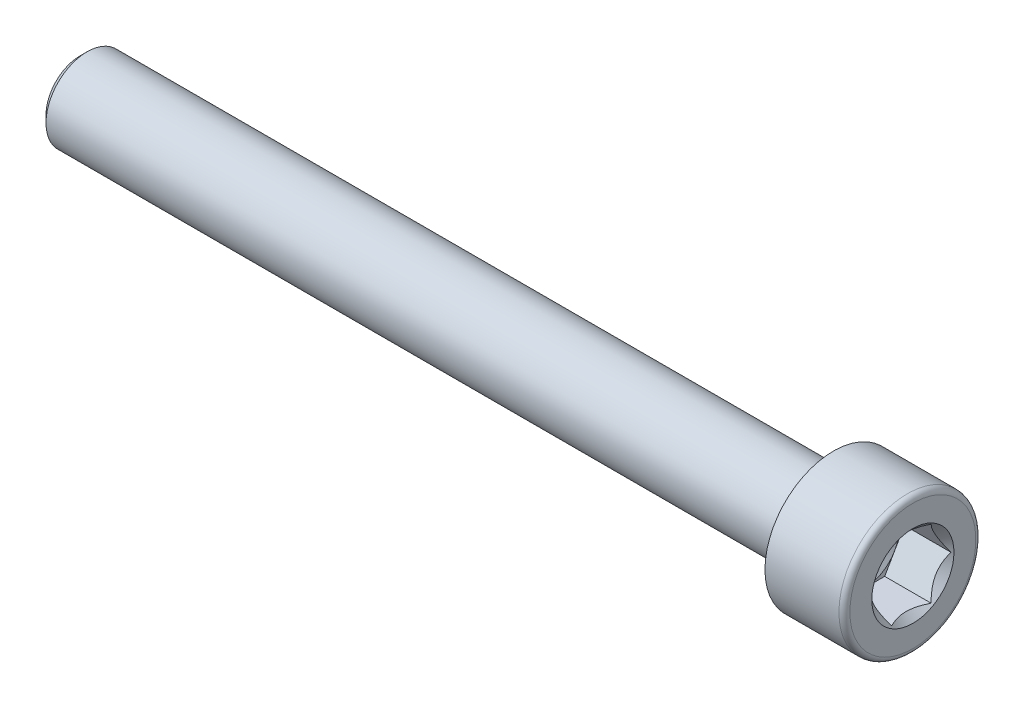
from build123d import *

# Parameters (mm, degrees)
CHANFREIN1_SIZE         = 0.5
ENL_V_MAT_EXTRU_1_DEPTH = 3.5


with BuildPart() as part:
    # Esquisse1 → Base-R_volution (revolve)
    with BuildSketch(Plane.XY, mode=Mode.PRIVATE) as base_r_volution_sk:
        with BuildLine():
            Line((0, 3), (0, 5))
            Line((0, 5), (5.4, 5))
            ThreePointArc((5.4, 5), (5.682842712, 4.882842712), (5.8, 4.6))
            Line((5.8, 4.6), (5.8, 3))
            Line((5.8, 3), (5.3, 2.5))
            Line((5.3, 2.5), (2.3, 2.5))
            Line((2.3, 2.5), (0.856624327, 0))
            Line((0.856624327, 0), (-55, 0))
            Line((-55, 0), (-55, 3))
            Line((-55, 3), (0, 3))
        make_face()
    revolve(base_r_volution_sk.sketch.rotate(Axis((-30, 0, 0), (1, 0, 0)), 90), axis=Axis((-30, 0, 0), (1, 0, 0)))

    # Chanfrein1
    chanfrein1_edges = [part.edges().sort_by_distance(p)[0] for p in [
        (-55, 0, -3),
    ]]
    chamfer(chanfrein1_edges, length=CHANFREIN1_SIZE)

    # Esquisse2 → Enl_v. mat.-Extru.1 (cut)
    with BuildSketch(Plane(origin=(5.8, 0, 0), x_dir=(0, 0, -1), z_dir=(1, 0, 0))):
        Polygon((-2.886751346, 0), (-1.443375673, -2.5), (1.443375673, -2.5), (2.886751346, 0), (1.443375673, 2.5), (-1.443375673, 2.5), align=None)
    extrude(amount=-ENL_V_MAT_EXTRU_1_DEPTH, mode=Mode.SUBTRACT)


solid = part.part
